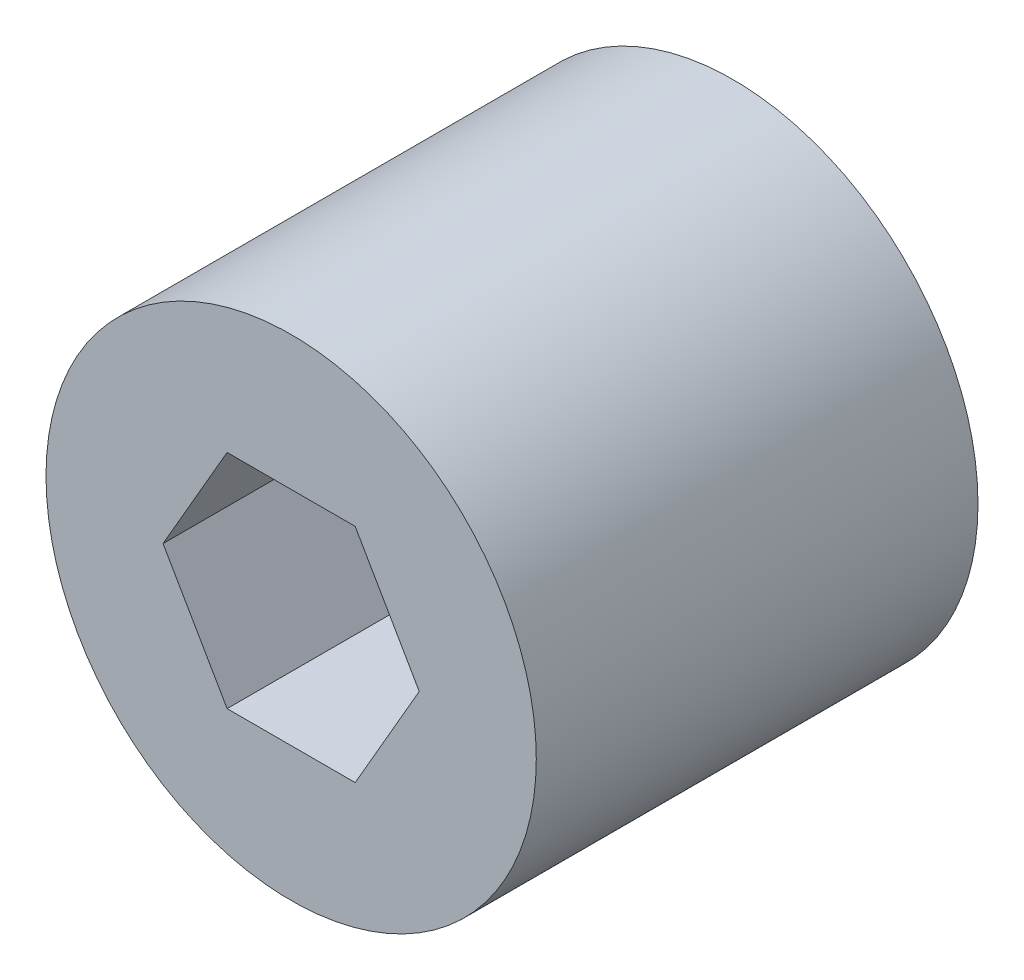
ISO-10303-21;
HEADER;
FILE_DESCRIPTION(('STEP AP214'),'2;1');
FILE_NAME('part.step','',(''),(''),'','','');
FILE_SCHEMA(('AUTOMOTIVE_DESIGN { 1 0 10303 214 1 1 1 1 }'));
ENDSEC;
DATA;
#1=APPLICATION_CONTEXT('core data for automotive mechanical design processes');
#2=APPLICATION_PROTOCOL_DEFINITION('international standard','automotive_design',2000,#1);
#3=PRODUCT_CONTEXT('',#1,'mechanical');
#4=PRODUCT('Part','Part','',(#3));
#5=PRODUCT_RELATED_PRODUCT_CATEGORY('part','',(#4));
#6=PRODUCT_DEFINITION_FORMATION('','',#4);
#7=PRODUCT_DEFINITION_CONTEXT('part definition',#1,'design');
#8=PRODUCT_DEFINITION('design','',#6,#7);
#9=PRODUCT_DEFINITION_SHAPE('','',#8);
#10=(LENGTH_UNIT() NAMED_UNIT(*) SI_UNIT(.MILLI.,.METRE.));
#11=(NAMED_UNIT(*) PLANE_ANGLE_UNIT() SI_UNIT($,.RADIAN.));
#12=(NAMED_UNIT(*) SI_UNIT($,.STERADIAN.) SOLID_ANGLE_UNIT());
#13=UNCERTAINTY_MEASURE_WITH_UNIT(LENGTH_MEASURE(1.E-05),#10,'distance_accuracy_value','');
#14=(GEOMETRIC_REPRESENTATION_CONTEXT(3) GLOBAL_UNCERTAINTY_ASSIGNED_CONTEXT((#13)) GLOBAL_UNIT_ASSIGNED_CONTEXT((#10,
#11,#12)) REPRESENTATION_CONTEXT('',''));
#15=CARTESIAN_POINT('',(0.,0.,0.));
#16=DIRECTION('',(0.,0.,1.));
#17=DIRECTION('',(1.,0.,0.));
#18=AXIS2_PLACEMENT_3D('',#15,#16,#17);
#19=CARTESIAN_POINT('',(0.,0.,25.4));
#20=DIRECTION('',(0.,0.,1.));
#21=DIRECTION('',(1.,0.,0.));
#22=AXIS2_PLACEMENT_3D('',#19,#20,#21);
#23=PLANE('',#22);
#24=CARTESIAN_POINT('',(0.,0.,25.4));
#25=DIRECTION('',(0.,0.,1.));
#26=DIRECTION('',(1.,0.,0.));
#27=AXIS2_PLACEMENT_3D('',#24,#25,#26);
#28=CIRCLE('',#27,14.097);
#29=CARTESIAN_POINT('',(14.097,0.,25.4));
#30=VERTEX_POINT('',#29);
#31=EDGE_CURVE('E11',#30,#30,#28,.T.);
#32=ORIENTED_EDGE('',*,*,#31,.T.);
#33=EDGE_LOOP('',(#32));
#34=FACE_BOUND('',#33,.T.);
#35=DIRECTION('',(-0.499999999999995,0.866025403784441,0.));
#36=VECTOR('',#35,1.);
#37=CARTESIAN_POINT('',(3.68300000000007,6.37914312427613,25.4));
#38=LINE('',#37,#36);
#39=CARTESIAN_POINT('',(7.366,0.,25.4));
#40=VERTEX_POINT('',#39);
#41=CARTESIAN_POINT('',(3.68300000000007,6.37914312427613,25.4));
#42=VERTEX_POINT('',#41);
#43=EDGE_CURVE('E94',#40,#42,#38,.T.);
#44=ORIENTED_EDGE('',*,*,#43,.F.);
#45=DIRECTION('',(0.500000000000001,0.866025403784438,0.));
#46=VECTOR('',#45,1.);
#47=CARTESIAN_POINT('',(7.366,0.,25.4));
#48=LINE('',#47,#46);
#49=CARTESIAN_POINT('',(3.68299999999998,-6.37914312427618,25.4));
#50=VERTEX_POINT('',#49);
#51=EDGE_CURVE('E86',#50,#40,#48,.T.);
#52=ORIENTED_EDGE('',*,*,#51,.F.);
#53=DIRECTION('',(1.,0.,0.));
#54=VECTOR('',#53,1.);
#55=CARTESIAN_POINT('',(3.68299999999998,-6.37914312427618,25.4));
#56=LINE('',#55,#54);
#57=CARTESIAN_POINT('',(-3.68300000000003,-6.37914312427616,25.4));
#58=VERTEX_POINT('',#57);
#59=EDGE_CURVE('E114',#58,#50,#56,.T.);
#60=ORIENTED_EDGE('',*,*,#59,.F.);
#61=DIRECTION('',(0.499999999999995,-0.866025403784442,0.));
#62=VECTOR('',#61,1.);
#63=CARTESIAN_POINT('',(-3.68300000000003,-6.37914312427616,25.4));
#64=LINE('',#63,#62);
#65=CARTESIAN_POINT('',(-7.366,0.,25.4));
#66=VERTEX_POINT('',#65);
#67=EDGE_CURVE('E112',#66,#58,#64,.T.);
#68=ORIENTED_EDGE('',*,*,#67,.F.);
#69=DIRECTION('',(-0.500000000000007,-0.866025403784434,0.));
#70=VECTOR('',#69,1.);
#71=CARTESIAN_POINT('',(-7.366,0.,25.4));
#72=LINE('',#71,#70);
#73=CARTESIAN_POINT('',(-3.68299999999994,6.37914312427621,25.4));
#74=VERTEX_POINT('',#73);
#75=EDGE_CURVE('E108',#74,#66,#72,.T.);
#76=ORIENTED_EDGE('',*,*,#75,.F.);
#77=DIRECTION('',(-1.,0.,0.));
#78=VECTOR('',#77,1.);
#79=CARTESIAN_POINT('',(-3.68299999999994,6.37914312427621,25.4));
#80=LINE('',#79,#78);
#81=EDGE_CURVE('E106',#42,#74,#80,.T.);
#82=ORIENTED_EDGE('',*,*,#81,.F.);
#83=EDGE_LOOP('',(#44,#52,#60,#68,#76,#82));
#84=FACE_BOUND('',#83,.T.);
#85=ADVANCED_FACE('F33',(#34,#84),#23,.T.);
#86=CARTESIAN_POINT('',(0.,0.,0.));
#87=DIRECTION('',(0.,0.,1.));
#88=DIRECTION('',(1.,0.,0.));
#89=AXIS2_PLACEMENT_3D('',#86,#87,#88);
#90=PLANE('',#89);
#91=CARTESIAN_POINT('',(0.,0.,0.));
#92=DIRECTION('',(0.,0.,1.));
#93=DIRECTION('',(1.,0.,0.));
#94=AXIS2_PLACEMENT_3D('',#91,#92,#93);
#95=CIRCLE('',#94,14.097);
#96=CARTESIAN_POINT('',(14.097,0.,0.));
#97=VERTEX_POINT('',#96);
#98=EDGE_CURVE('E37',#97,#97,#95,.T.);
#99=ORIENTED_EDGE('',*,*,#98,.F.);
#100=EDGE_LOOP('',(#99));
#101=FACE_BOUND('',#100,.T.);
#102=DIRECTION('',(0.500000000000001,0.866025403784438,0.));
#103=VECTOR('',#102,1.);
#104=CARTESIAN_POINT('',(7.366,0.,0.));
#105=LINE('',#104,#103);
#106=CARTESIAN_POINT('',(3.68299999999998,-6.37914312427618,0.));
#107=VERTEX_POINT('',#106);
#108=CARTESIAN_POINT('',(7.366,0.,0.));
#109=VERTEX_POINT('',#108);
#110=EDGE_CURVE('E56',#107,#109,#105,.T.);
#111=ORIENTED_EDGE('',*,*,#110,.T.);
#112=DIRECTION('',(-0.499999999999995,0.866025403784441,0.));
#113=VECTOR('',#112,1.);
#114=CARTESIAN_POINT('',(3.68300000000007,6.37914312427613,0.));
#115=LINE('',#114,#113);
#116=CARTESIAN_POINT('',(3.68300000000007,6.37914312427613,0.));
#117=VERTEX_POINT('',#116);
#118=EDGE_CURVE('E101',#109,#117,#115,.T.);
#119=ORIENTED_EDGE('',*,*,#118,.T.);
#120=DIRECTION('',(-1.,0.,0.));
#121=VECTOR('',#120,1.);
#122=CARTESIAN_POINT('',(-3.68299999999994,6.37914312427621,0.));
#123=LINE('',#122,#121);
#124=CARTESIAN_POINT('',(-3.68299999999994,6.37914312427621,0.));
#125=VERTEX_POINT('',#124);
#126=EDGE_CURVE('E118',#117,#125,#123,.T.);
#127=ORIENTED_EDGE('',*,*,#126,.T.);
#128=DIRECTION('',(-0.500000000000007,-0.866025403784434,0.));
#129=VECTOR('',#128,1.);
#130=CARTESIAN_POINT('',(-7.366,0.,0.));
#131=LINE('',#130,#129);
#132=CARTESIAN_POINT('',(-7.366,0.,0.));
#133=VERTEX_POINT('',#132);
#134=EDGE_CURVE('E121',#125,#133,#131,.T.);
#135=ORIENTED_EDGE('',*,*,#134,.T.);
#136=DIRECTION('',(0.499999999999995,-0.866025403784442,0.));
#137=VECTOR('',#136,1.);
#138=CARTESIAN_POINT('',(-3.68300000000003,-6.37914312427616,0.));
#139=LINE('',#138,#137);
#140=CARTESIAN_POINT('',(-3.68300000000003,-6.37914312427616,0.));
#141=VERTEX_POINT('',#140);
#142=EDGE_CURVE('E124',#133,#141,#139,.T.);
#143=ORIENTED_EDGE('',*,*,#142,.T.);
#144=DIRECTION('',(1.,0.,0.));
#145=VECTOR('',#144,1.);
#146=CARTESIAN_POINT('',(3.68299999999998,-6.37914312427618,0.));
#147=LINE('',#146,#145);
#148=EDGE_CURVE('E95',#141,#107,#147,.T.);
#149=ORIENTED_EDGE('',*,*,#148,.T.);
#150=EDGE_LOOP('',(#111,#119,#127,#135,#143,#149));
#151=FACE_BOUND('',#150,.T.);
#152=ADVANCED_FACE('F141',(#101,#151),#90,.F.);
#153=CARTESIAN_POINT('',(0.,0.,25.4));
#154=DIRECTION('',(0.,0.,-1.));
#155=DIRECTION('',(-1.,0.,0.));
#156=AXIS2_PLACEMENT_3D('',#153,#154,#155);
#157=CYLINDRICAL_SURFACE('',#156,14.097);
#158=ORIENTED_EDGE('',*,*,#31,.F.);
#159=EDGE_LOOP('',(#158));
#160=FACE_BOUND('',#159,.T.);
#161=ORIENTED_EDGE('',*,*,#98,.T.);
#162=EDGE_LOOP('',(#161));
#163=FACE_BOUND('',#162,.T.);
#164=ADVANCED_FACE('F35',(#160,#163),#157,.T.);
#165=CARTESIAN_POINT('',(7.366,0.,25.4));
#166=DIRECTION('',(-0.866025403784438,0.500000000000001,0.));
#167=DIRECTION('',(-0.500000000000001,-0.866025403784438,0.));
#168=AXIS2_PLACEMENT_3D('',#165,#166,#167);
#169=PLANE('',#168);
#170=ORIENTED_EDGE('',*,*,#110,.F.);
#171=DIRECTION('',(0.,0.,-1.));
#172=VECTOR('',#171,1.);
#173=CARTESIAN_POINT('',(3.68299999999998,-6.37914312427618,25.4));
#174=LINE('',#173,#172);
#175=EDGE_CURVE('E90',#50,#107,#174,.T.);
#176=ORIENTED_EDGE('',*,*,#175,.F.);
#177=ORIENTED_EDGE('',*,*,#51,.T.);
#178=DIRECTION('',(0.,0.,-1.));
#179=VECTOR('',#178,1.);
#180=CARTESIAN_POINT('',(7.366,0.,25.4));
#181=LINE('',#180,#179);
#182=EDGE_CURVE('E89',#40,#109,#181,.T.);
#183=ORIENTED_EDGE('',*,*,#182,.T.);
#184=EDGE_LOOP('',(#170,#176,#177,#183));
#185=FACE_BOUND('',#184,.T.);
#186=ADVANCED_FACE('F88',(#185),#169,.T.);
#187=CARTESIAN_POINT('',(3.68300000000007,6.37914312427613,25.4));
#188=DIRECTION('',(-0.866025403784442,-0.499999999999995,0.));
#189=DIRECTION('',(0.499999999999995,-0.866025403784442,0.));
#190=AXIS2_PLACEMENT_3D('',#187,#188,#189);
#191=PLANE('',#190);
#192=ORIENTED_EDGE('',*,*,#118,.F.);
#193=ORIENTED_EDGE('',*,*,#182,.F.);
#194=ORIENTED_EDGE('',*,*,#43,.T.);
#195=DIRECTION('',(0.,0.,-1.));
#196=VECTOR('',#195,1.);
#197=CARTESIAN_POINT('',(3.68300000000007,6.37914312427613,25.4));
#198=LINE('',#197,#196);
#199=EDGE_CURVE('E102',#42,#117,#198,.T.);
#200=ORIENTED_EDGE('',*,*,#199,.T.);
#201=EDGE_LOOP('',(#192,#193,#194,#200));
#202=FACE_BOUND('',#201,.T.);
#203=ADVANCED_FACE('F98',(#202),#191,.T.);
#204=CARTESIAN_POINT('',(-3.68299999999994,6.37914312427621,25.4));
#205=DIRECTION('',(0.,-1.,0.));
#206=DIRECTION('',(1.,0.,0.));
#207=AXIS2_PLACEMENT_3D('',#204,#205,#206);
#208=PLANE('',#207);
#209=ORIENTED_EDGE('',*,*,#126,.F.);
#210=ORIENTED_EDGE('',*,*,#199,.F.);
#211=ORIENTED_EDGE('',*,*,#81,.T.);
#212=DIRECTION('',(0.,0.,-1.));
#213=VECTOR('',#212,1.);
#214=CARTESIAN_POINT('',(-3.68299999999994,6.37914312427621,25.4));
#215=LINE('',#214,#213);
#216=EDGE_CURVE('E133',#74,#125,#215,.T.);
#217=ORIENTED_EDGE('',*,*,#216,.T.);
#218=EDGE_LOOP('',(#209,#210,#211,#217));
#219=FACE_BOUND('',#218,.T.);
#220=ADVANCED_FACE('F137',(#219),#208,.T.);
#221=CARTESIAN_POINT('',(-7.366,0.,25.4));
#222=DIRECTION('',(0.866025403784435,-0.500000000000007,0.));
#223=DIRECTION('',(0.500000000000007,0.866025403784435,0.));
#224=AXIS2_PLACEMENT_3D('',#221,#222,#223);
#225=PLANE('',#224);
#226=ORIENTED_EDGE('',*,*,#134,.F.);
#227=ORIENTED_EDGE('',*,*,#216,.F.);
#228=ORIENTED_EDGE('',*,*,#75,.T.);
#229=DIRECTION('',(0.,0.,-1.));
#230=VECTOR('',#229,1.);
#231=CARTESIAN_POINT('',(-7.366,0.,25.4));
#232=LINE('',#231,#230);
#233=EDGE_CURVE('E131',#66,#133,#232,.T.);
#234=ORIENTED_EDGE('',*,*,#233,.T.);
#235=EDGE_LOOP('',(#226,#227,#228,#234));
#236=FACE_BOUND('',#235,.T.);
#237=ADVANCED_FACE('F149',(#236),#225,.T.);
#238=CARTESIAN_POINT('',(-3.68300000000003,-6.37914312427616,25.4));
#239=DIRECTION('',(0.866025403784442,0.499999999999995,0.));
#240=DIRECTION('',(-0.499999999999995,0.866025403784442,0.));
#241=AXIS2_PLACEMENT_3D('',#238,#239,#240);
#242=PLANE('',#241);
#243=ORIENTED_EDGE('',*,*,#142,.F.);
#244=ORIENTED_EDGE('',*,*,#233,.F.);
#245=ORIENTED_EDGE('',*,*,#67,.T.);
#246=DIRECTION('',(0.,0.,-1.));
#247=VECTOR('',#246,1.);
#248=CARTESIAN_POINT('',(-3.68300000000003,-6.37914312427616,25.4));
#249=LINE('',#248,#247);
#250=EDGE_CURVE('E48',#58,#141,#249,.T.);
#251=ORIENTED_EDGE('',*,*,#250,.T.);
#252=EDGE_LOOP('',(#243,#244,#245,#251));
#253=FACE_BOUND('',#252,.T.);
#254=ADVANCED_FACE('F147',(#253),#242,.T.);
#255=CARTESIAN_POINT('',(3.68299999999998,-6.37914312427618,25.4));
#256=DIRECTION('',(0.,1.,0.));
#257=DIRECTION('',(-1.,0.,0.));
#258=AXIS2_PLACEMENT_3D('',#255,#256,#257);
#259=PLANE('',#258);
#260=ORIENTED_EDGE('',*,*,#148,.F.);
#261=ORIENTED_EDGE('',*,*,#250,.F.);
#262=ORIENTED_EDGE('',*,*,#59,.T.);
#263=ORIENTED_EDGE('',*,*,#175,.T.);
#264=EDGE_LOOP('',(#260,#261,#262,#263));
#265=FACE_BOUND('',#264,.T.);
#266=ADVANCED_FACE('F143',(#265),#259,.T.);
#267=CLOSED_SHELL('',(#85,#152,#164,#186,#203,#220,#237,#254,#266));
#268=MANIFOLD_SOLID_BREP('B2',#267);
#269=ADVANCED_BREP_SHAPE_REPRESENTATION('',(#18,#268),#14);
#270=SHAPE_DEFINITION_REPRESENTATION(#9,#269);
ENDSEC;
END-ISO-10303-21;
